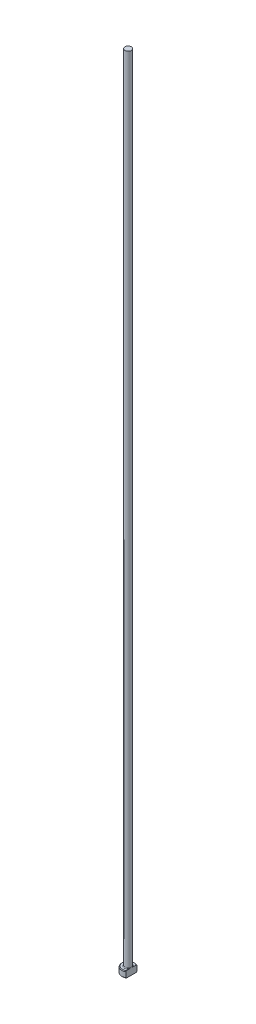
ISO-10303-21;
HEADER;
FILE_DESCRIPTION(('STEP AP214'),'2;1');
FILE_NAME('part.step','',(''),(''),'','','');
FILE_SCHEMA(('AUTOMOTIVE_DESIGN { 1 0 10303 214 1 1 1 1 }'));
ENDSEC;
DATA;
#1=APPLICATION_CONTEXT('core data for automotive mechanical design processes');
#2=APPLICATION_PROTOCOL_DEFINITION('international standard','automotive_design',2000,#1);
#3=PRODUCT_CONTEXT('',#1,'mechanical');
#4=PRODUCT('Part','Part','',(#3));
#5=PRODUCT_RELATED_PRODUCT_CATEGORY('part','',(#4));
#6=PRODUCT_DEFINITION_FORMATION('','',#4);
#7=PRODUCT_DEFINITION_CONTEXT('part definition',#1,'design');
#8=PRODUCT_DEFINITION('design','',#6,#7);
#9=PRODUCT_DEFINITION_SHAPE('','',#8);
#10=(LENGTH_UNIT() NAMED_UNIT(*) SI_UNIT(.MILLI.,.METRE.));
#11=(NAMED_UNIT(*) PLANE_ANGLE_UNIT() SI_UNIT($,.RADIAN.));
#12=(NAMED_UNIT(*) SI_UNIT($,.STERADIAN.) SOLID_ANGLE_UNIT());
#13=UNCERTAINTY_MEASURE_WITH_UNIT(LENGTH_MEASURE(1.E-05),#10,'distance_accuracy_value','');
#14=(GEOMETRIC_REPRESENTATION_CONTEXT(3) GLOBAL_UNCERTAINTY_ASSIGNED_CONTEXT((#13)) GLOBAL_UNIT_ASSIGNED_CONTEXT((#10,
#11,#12)) REPRESENTATION_CONTEXT('',''));
#15=CARTESIAN_POINT('',(0.,0.,0.));
#16=DIRECTION('',(0.,0.,1.));
#17=DIRECTION('',(1.,0.,0.));
#18=AXIS2_PLACEMENT_3D('',#15,#16,#17);
#19=CARTESIAN_POINT('',(0.,0.,0.));
#20=DIRECTION('',(0.,-1.,0.));
#21=DIRECTION('',(0.,0.,-1.));
#22=AXIS2_PLACEMENT_3D('',#19,#20,#21);
#23=PLANE('',#22);
#24=CARTESIAN_POINT('',(0.,0.,0.));
#25=DIRECTION('',(0.,-1.,0.));
#26=DIRECTION('',(0.,0.,-1.));
#27=AXIS2_PLACEMENT_3D('',#24,#25,#26);
#28=CIRCLE('',#27,1.8);
#29=CARTESIAN_POINT('',(0.999999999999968,0.,1.49666295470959));
#30=VERTEX_POINT('',#29);
#31=CARTESIAN_POINT('',(0.999999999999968,0.,-1.49666295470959));
#32=VERTEX_POINT('',#31);
#33=EDGE_CURVE('E98',#30,#32,#28,.T.);
#34=ORIENTED_EDGE('',*,*,#33,.T.);
#35=DIRECTION('',(0.,0.,1.));
#36=VECTOR('',#35,1.);
#37=CARTESIAN_POINT('',(0.999999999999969,0.,-1.73205080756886));
#38=LINE('',#37,#36);
#39=EDGE_CURVE('E83',#32,#30,#38,.T.);
#40=ORIENTED_EDGE('',*,*,#39,.T.);
#41=EDGE_LOOP('',(#34,#40));
#42=FACE_BOUND('',#41,.T.);
#43=ADVANCED_FACE('F32',(#42),#23,.T.);
#44=CARTESIAN_POINT('',(0.,259.958771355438,0.));
#45=DIRECTION('',(0.,1.,0.));
#46=DIRECTION('',(0.,0.,1.));
#47=AXIS2_PLACEMENT_3D('',#44,#45,#46);
#48=CYLINDRICAL_SURFACE('',#47,1.99999999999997);
#49=CARTESIAN_POINT('',(0.,1.79999999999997,0.));
#50=DIRECTION('',(0.,1.,0.));
#51=DIRECTION('',(0.,0.,1.));
#52=AXIS2_PLACEMENT_3D('',#49,#50,#51);
#53=CIRCLE('',#52,1.99999999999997);
#54=CARTESIAN_POINT('',(0.999999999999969,1.79999999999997,1.73205080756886));
#55=VERTEX_POINT('',#54);
#56=CARTESIAN_POINT('',(0.999999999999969,1.79999999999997,-1.73205080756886));
#57=VERTEX_POINT('',#56);
#58=EDGE_CURVE('E104',#55,#57,#53,.F.);
#59=ORIENTED_EDGE('',*,*,#58,.T.);
#60=DIRECTION('',(0.,-1.,0.));
#61=VECTOR('',#60,1.);
#62=CARTESIAN_POINT('',(0.999999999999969,250.,-1.73205080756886));
#63=LINE('',#62,#61);
#64=CARTESIAN_POINT('',(0.999999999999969,0.199999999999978,-1.73205080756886));
#65=VERTEX_POINT('',#64);
#66=EDGE_CURVE('E183',#57,#65,#63,.T.);
#67=ORIENTED_EDGE('',*,*,#66,.T.);
#68=CARTESIAN_POINT('',(0.,0.199999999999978,0.));
#69=DIRECTION('',(0.,-1.,0.));
#70=DIRECTION('',(0.,0.,-1.));
#71=AXIS2_PLACEMENT_3D('',#68,#69,#70);
#72=CIRCLE('',#71,1.99999999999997);
#73=CARTESIAN_POINT('',(0.999999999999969,0.199999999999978,1.73205080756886));
#74=VERTEX_POINT('',#73);
#75=EDGE_CURVE('E100',#65,#74,#72,.F.);
#76=ORIENTED_EDGE('',*,*,#75,.T.);
#77=DIRECTION('',(0.,-1.,0.));
#78=VECTOR('',#77,1.);
#79=CARTESIAN_POINT('',(0.999999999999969,250.,1.73205080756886));
#80=LINE('',#79,#78);
#81=EDGE_CURVE('E93',#55,#74,#80,.T.);
#82=ORIENTED_EDGE('',*,*,#81,.F.);
#83=EDGE_LOOP('',(#59,#67,#76,#82));
#84=FACE_BOUND('',#83,.T.);
#85=ADVANCED_FACE('F158',(#84),#48,.T.);
#86=CARTESIAN_POINT('',(-1.99999999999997,2.,0.));
#87=DIRECTION('',(0.,1.,0.));
#88=DIRECTION('',(0.,0.,1.));
#89=AXIS2_PLACEMENT_3D('',#86,#87,#88);
#90=PLANE('',#89);
#91=CARTESIAN_POINT('',(0.,2.,0.));
#92=DIRECTION('',(0.,1.,0.));
#93=DIRECTION('',(0.,0.,1.));
#94=AXIS2_PLACEMENT_3D('',#91,#92,#93);
#95=CIRCLE('',#94,1.79999999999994);
#96=CARTESIAN_POINT('',(0.999999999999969,2.,-1.49666295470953));
#97=VERTEX_POINT('',#96);
#98=CARTESIAN_POINT('',(0.999999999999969,2.,1.49666295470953));
#99=VERTEX_POINT('',#98);
#100=EDGE_CURVE('E178',#97,#99,#95,.T.);
#101=ORIENTED_EDGE('',*,*,#100,.T.);
#102=DIRECTION('',(0.,0.,-1.));
#103=VECTOR('',#102,1.);
#104=CARTESIAN_POINT('',(0.999999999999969,2.,0.));
#105=LINE('',#104,#103);
#106=CARTESIAN_POINT('',(0.999999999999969,1.99999999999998,0.66332495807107));
#107=VERTEX_POINT('',#106);
#108=EDGE_CURVE('E57',#99,#107,#105,.T.);
#109=ORIENTED_EDGE('',*,*,#108,.T.);
#110=CARTESIAN_POINT('',(0.,2.,0.));
#111=DIRECTION('',(0.,1.,0.));
#112=DIRECTION('',(0.,0.,1.));
#113=AXIS2_PLACEMENT_3D('',#110,#111,#112);
#114=CIRCLE('',#113,1.19999999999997);
#115=CARTESIAN_POINT('',(0.999999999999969,1.99999999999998,-0.663324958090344));
#116=VERTEX_POINT('',#115);
#117=EDGE_CURVE('E107',#107,#116,#114,.F.);
#118=ORIENTED_EDGE('',*,*,#117,.T.);
#119=EDGE_CURVE('E136',#116,#97,#105,.T.);
#120=ORIENTED_EDGE('',*,*,#119,.T.);
#121=EDGE_LOOP('',(#101,#109,#118,#120));
#122=FACE_BOUND('',#121,.T.);
#123=ADVANCED_FACE('F147',(#122),#90,.T.);
#124=CARTESIAN_POINT('',(0.,2.,0.));
#125=DIRECTION('',(0.,-1.,0.));
#126=DIRECTION('',(0.,0.,-1.));
#127=AXIS2_PLACEMENT_3D('',#124,#125,#126);
#128=CONICAL_SURFACE('',#127,1.79999999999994,0.785398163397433);
#129=ORIENTED_EDGE('',*,*,#58,.F.);
#130=CARTESIAN_POINT('',(0.999999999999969,-0.143084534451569,3.81417299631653));
#131=CARTESIAN_POINT('',(0.999999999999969,-0.059399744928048,3.72765647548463));
#132=CARTESIAN_POINT('',(0.999999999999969,0.0241940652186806,3.64105173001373));
#133=CARTESIAN_POINT('',(0.999999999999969,0.191148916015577,3.46761616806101));
#134=CARTESIAN_POINT('',(0.999999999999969,0.274509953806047,3.38078534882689));
#135=CARTESIAN_POINT('',(0.999999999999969,0.524249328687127,3.11979400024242));
#136=CARTESIAN_POINT('',(0.999999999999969,0.69019863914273,2.94522254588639));
#137=CARTESIAN_POINT('',(0.999999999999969,1.01697550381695,2.59782670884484));
#138=CARTESIAN_POINT('',(0.999999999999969,1.17783928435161,2.42503661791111));
#139=CARTESIAN_POINT('',(0.999999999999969,1.41669118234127,2.16364984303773));
#140=CARTESIAN_POINT('',(0.999999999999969,1.49589273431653,2.07616357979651));
#141=CARTESIAN_POINT('',(0.999999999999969,1.65313803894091,1.90015721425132));
#142=CARTESIAN_POINT('',(0.999999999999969,1.73118183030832,1.81163714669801));
#143=CARTESIAN_POINT('',(0.999999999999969,1.85567318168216,1.66767927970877));
#144=CARTESIAN_POINT('',(0.999999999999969,1.90265415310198,1.61270332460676));
#145=CARTESIAN_POINT('',(0.999999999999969,1.99577882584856,1.50203557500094));
#146=CARTESIAN_POINT('',(0.999999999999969,2.04192244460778,1.44634371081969));
#147=CARTESIAN_POINT('',(0.999999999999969,2.13356596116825,1.33345480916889));
#148=CARTESIAN_POINT('',(0.999999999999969,2.17905399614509,1.2762481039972));
#149=CARTESIAN_POINT('',(0.999999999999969,2.26844283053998,1.16060976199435));
#150=CARTESIAN_POINT('',(0.999999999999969,2.3123437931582,1.10217825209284));
#151=CARTESIAN_POINT('',(0.999999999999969,2.39853453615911,0.982773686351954));
#152=CARTESIAN_POINT('',(0.999999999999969,2.44078986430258,0.921775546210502));
#153=CARTESIAN_POINT('',(0.999999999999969,2.52187810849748,0.797387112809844));
#154=CARTESIAN_POINT('',(0.999999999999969,2.56070631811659,0.733993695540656));
#155=CARTESIAN_POINT('',(0.999999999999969,2.6324859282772,0.604932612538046));
#156=CARTESIAN_POINT('',(0.999999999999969,2.66550424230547,0.539302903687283));
#157=CARTESIAN_POINT('',(0.999999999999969,2.72301550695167,0.404437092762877));
#158=CARTESIAN_POINT('',(0.999999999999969,2.74753707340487,0.335214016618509));
#159=CARTESIAN_POINT('',(0.999999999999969,2.77407110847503,0.231400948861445));
#160=CARTESIAN_POINT('',(0.999999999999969,2.78110742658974,0.198093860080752));
#161=CARTESIAN_POINT('',(0.999999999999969,2.79200506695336,0.130954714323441));
#162=CARTESIAN_POINT('',(0.999999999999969,2.7958666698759,0.0971227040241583));
#163=CARTESIAN_POINT('',(0.999999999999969,2.80013905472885,0.0293410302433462));
#164=CARTESIAN_POINT('',(0.999999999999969,2.80056046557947,-0.00460794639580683));
#165=CARTESIAN_POINT('',(0.999999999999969,2.79795882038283,-0.0723663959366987));
#166=CARTESIAN_POINT('',(0.999999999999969,2.79493547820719,-0.106175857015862));
#167=CARTESIAN_POINT('',(0.999999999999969,2.78105481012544,-0.206326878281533));
#168=CARTESIAN_POINT('',(0.999999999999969,2.76542146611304,-0.272037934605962));
#169=CARTESIAN_POINT('',(0.999999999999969,2.73477554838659,-0.368312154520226));
#170=CARTESIAN_POINT('',(0.999999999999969,2.72331063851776,-0.400123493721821));
#171=CARTESIAN_POINT('',(0.999999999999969,2.69840546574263,-0.46296441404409));
#172=CARTESIAN_POINT('',(0.999999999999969,2.68496560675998,-0.493994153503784));
#173=CARTESIAN_POINT('',(0.999999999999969,2.64209309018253,-0.586298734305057));
#174=CARTESIAN_POINT('',(0.999999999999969,2.61022871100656,-0.64643570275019));
#175=CARTESIAN_POINT('',(0.999999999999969,2.5422853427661,-0.764304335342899));
#176=CARTESIAN_POINT('',(0.999999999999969,2.50620119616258,-0.822032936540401));
#177=CARTESIAN_POINT('',(0.999999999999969,2.43107084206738,-0.935840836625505));
#178=CARTESIAN_POINT('',(0.999999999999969,2.39201347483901,-0.99191270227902));
#179=CARTESIAN_POINT('',(0.999999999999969,2.31195870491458,-1.10259849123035));
#180=CARTESIAN_POINT('',(0.999999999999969,2.27096226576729,-1.15721311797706));
#181=CARTESIAN_POINT('',(0.999999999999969,2.18701695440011,-1.26606869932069));
#182=CARTESIAN_POINT('',(0.999999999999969,2.14404946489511,-1.32029522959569));
#183=CARTESIAN_POINT('',(0.999999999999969,2.0570505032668,-1.4278898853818));
#184=CARTESIAN_POINT('',(0.999999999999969,2.01301896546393,-1.48125795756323));
#185=CARTESIAN_POINT('',(0.999999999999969,1.87995068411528,-1.64010952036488));
#186=CARTESIAN_POINT('',(0.999999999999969,1.78973357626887,-1.74460261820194));
#187=CARTESIAN_POINT('',(0.999999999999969,1.62290341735,-1.93426834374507));
#188=CARTESIAN_POINT('',(0.999999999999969,1.54658658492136,-2.01970404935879));
#189=CARTESIAN_POINT('',(0.999999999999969,1.39301250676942,-2.18973019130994));
#190=CARTESIAN_POINT('',(0.999999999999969,1.31575523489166,-2.27432060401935));
#191=CARTESIAN_POINT('',(0.999999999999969,1.08283440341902,-2.52732479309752));
#192=CARTESIAN_POINT('',(0.999999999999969,0.926165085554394,-2.69481086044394));
#193=CARTESIAN_POINT('',(0.999999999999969,0.617772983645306,-3.02147252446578));
#194=CARTESIAN_POINT('',(0.999999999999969,0.466111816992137,-3.18070657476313));
#195=CARTESIAN_POINT('',(0.999999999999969,0.23801507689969,-3.41880818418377));
#196=CARTESIAN_POINT('',(0.999999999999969,0.161924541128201,-3.49800657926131));
#197=CARTESIAN_POINT('',(0.999999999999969,0.00955322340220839,-3.65621892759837));
#198=CARTESIAN_POINT('',(0.999999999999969,-0.0667275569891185,-3.73523288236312));
#199=CARTESIAN_POINT('',(0.999999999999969,-0.143084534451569,-3.81417299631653));
#200=B_SPLINE_CURVE_WITH_KNOTS('',3,(#130,#131,#132,#133,#134,#135,#136,#137,#138,#139,#140,
#141,#142,#143,#144,#145,#146,#147,#148,#149,#150,#151,#152,#153,#154,#155,#156,#157,#158,#159,
#160,#161,#162,#163,#164,#165,#166,#167,#168,#169,#170,#171,#172,#173,#174,#175,#176,#177,#178,
#179,#180,#181,#182,#183,#184,#185,#186,#187,#188,#189,#190,#191,#192,#193,#194,#195,#196,#197,
#198,#199),.UNSPECIFIED.,.F.,.F.,(4,2,2,2,2,2,2,2,2,2,2,2,2,2,2,2,2,2,2,2,2,2,2,2,2,2,2,2,2,2,2,
2,2,2,4),(0.,0.361101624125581,0.722207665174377,1.44478731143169,2.15299784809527,
2.50702638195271,2.8610430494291,3.07798416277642,3.29494655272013,3.51418925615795,
3.73340935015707,3.95594813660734,4.17878792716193,4.39886399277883,4.61819150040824,
4.72018864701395,4.82217677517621,4.92384967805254,5.02553102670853,5.22698459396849,
5.32838854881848,5.4297717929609,5.63365200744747,5.837784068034,6.04272417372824,
6.24756349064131,6.45510395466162,6.66265726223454,7.07676259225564,7.42043039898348,
7.7641077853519,8.45210822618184,9.1118082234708,9.44129145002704,9.77077197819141),.UNSPECIFIED.);
#201=EDGE_CURVE('E135',#55,#99,#200,.T.);
#202=ORIENTED_EDGE('',*,*,#201,.T.);
#203=ORIENTED_EDGE('',*,*,#100,.F.);
#204=EDGE_CURVE('E127',#97,#57,#200,.T.);
#205=ORIENTED_EDGE('',*,*,#204,.T.);
#206=EDGE_LOOP('',(#129,#202,#203,#205));
#207=FACE_BOUND('',#206,.T.);
#208=ADVANCED_FACE('F143',(#207),#128,.T.);
#209=CARTESIAN_POINT('',(0.,0.199999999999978,0.));
#210=DIRECTION('',(0.,1.,0.));
#211=DIRECTION('',(0.,0.,1.));
#212=AXIS2_PLACEMENT_3D('',#209,#210,#211);
#213=CONICAL_SURFACE('',#212,1.99999999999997,0.785398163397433);
#214=ORIENTED_EDGE('',*,*,#75,.F.);
#215=CARTESIAN_POINT('',(0.999999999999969,2.14308453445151,-3.81417299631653));
#216=CARTESIAN_POINT('',(0.999999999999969,2.05939974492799,-3.72765647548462));
#217=CARTESIAN_POINT('',(0.999999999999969,1.97580593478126,-3.64105173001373));
#218=CARTESIAN_POINT('',(0.999999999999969,1.80885108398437,-3.46761616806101));
#219=CARTESIAN_POINT('',(0.999999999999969,1.7254900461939,-3.38078534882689));
#220=CARTESIAN_POINT('',(0.999999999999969,1.47575067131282,-3.11979400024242));
#221=CARTESIAN_POINT('',(0.999999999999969,1.30980136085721,-2.94522254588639));
#222=CARTESIAN_POINT('',(0.999999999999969,0.983024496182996,-2.59782670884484));
#223=CARTESIAN_POINT('',(0.999999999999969,0.822160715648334,-2.42503661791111));
#224=CARTESIAN_POINT('',(0.999999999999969,0.583308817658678,-2.16364984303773));
#225=CARTESIAN_POINT('',(0.999999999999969,0.504107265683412,-2.07616357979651));
#226=CARTESIAN_POINT('',(0.999999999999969,0.346861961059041,-1.90015721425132));
#227=CARTESIAN_POINT('',(0.999999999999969,0.268818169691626,-1.81163714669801));
#228=CARTESIAN_POINT('',(0.999999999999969,0.144326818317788,-1.66767927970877));
#229=CARTESIAN_POINT('',(0.999999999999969,0.0973458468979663,-1.61270332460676));
#230=CARTESIAN_POINT('',(0.999999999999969,0.00422117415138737,-1.50203557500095));
#231=CARTESIAN_POINT('',(0.999999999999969,-0.0419224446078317,-1.44634371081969));
#232=CARTESIAN_POINT('',(0.999999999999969,-0.133565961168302,-1.3334548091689));
#233=CARTESIAN_POINT('',(0.999999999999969,-0.179053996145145,-1.2762481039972));
#234=CARTESIAN_POINT('',(0.999999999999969,-0.268442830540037,-1.16060976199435));
#235=CARTESIAN_POINT('',(0.999999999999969,-0.31234379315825,-1.10217825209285));
#236=CARTESIAN_POINT('',(0.999999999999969,-0.398534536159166,-0.982773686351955));
#237=CARTESIAN_POINT('',(0.999999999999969,-0.440789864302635,-0.921775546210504));
#238=CARTESIAN_POINT('',(0.999999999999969,-0.521878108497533,-0.797387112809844));
#239=CARTESIAN_POINT('',(0.999999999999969,-0.560706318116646,-0.733993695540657));
#240=CARTESIAN_POINT('',(0.999999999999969,-0.632485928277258,-0.604932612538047));
#241=CARTESIAN_POINT('',(0.999999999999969,-0.665504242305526,-0.539302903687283));
#242=CARTESIAN_POINT('',(0.999999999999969,-0.723015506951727,-0.404437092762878));
#243=CARTESIAN_POINT('',(0.999999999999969,-0.747537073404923,-0.33521401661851));
#244=CARTESIAN_POINT('',(0.999999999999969,-0.774071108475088,-0.231400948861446));
#245=CARTESIAN_POINT('',(0.999999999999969,-0.781107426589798,-0.198093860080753));
#246=CARTESIAN_POINT('',(0.999999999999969,-0.792005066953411,-0.130954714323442));
#247=CARTESIAN_POINT('',(0.999999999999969,-0.795866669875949,-0.0971227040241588));
#248=CARTESIAN_POINT('',(0.999999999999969,-0.8001390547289,-0.0293410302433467));
#249=CARTESIAN_POINT('',(0.999999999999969,-0.800560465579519,0.00460794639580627));
#250=CARTESIAN_POINT('',(0.999999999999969,-0.797958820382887,0.0723663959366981));
#251=CARTESIAN_POINT('',(0.999999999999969,-0.794935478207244,0.106175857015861));
#252=CARTESIAN_POINT('',(0.999999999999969,-0.78105481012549,0.206326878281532));
#253=CARTESIAN_POINT('',(0.999999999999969,-0.765421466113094,0.272037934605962));
#254=CARTESIAN_POINT('',(0.999999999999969,-0.734775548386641,0.368312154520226));
#255=CARTESIAN_POINT('',(0.999999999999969,-0.723310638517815,0.40012349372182));
#256=CARTESIAN_POINT('',(0.999999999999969,-0.698405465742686,0.46296441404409));
#257=CARTESIAN_POINT('',(0.999999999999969,-0.684965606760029,0.493994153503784));
#258=CARTESIAN_POINT('',(0.999999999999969,-0.642093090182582,0.586298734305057));
#259=CARTESIAN_POINT('',(0.999999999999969,-0.610228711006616,0.64643570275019));
#260=CARTESIAN_POINT('',(0.999999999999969,-0.542285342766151,0.764304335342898));
#261=CARTESIAN_POINT('',(0.999999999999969,-0.506201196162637,0.8220329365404));
#262=CARTESIAN_POINT('',(0.999999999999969,-0.431070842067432,0.935840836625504));
#263=CARTESIAN_POINT('',(0.999999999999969,-0.392013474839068,0.991912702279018));
#264=CARTESIAN_POINT('',(0.999999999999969,-0.311958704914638,1.10259849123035));
#265=CARTESIAN_POINT('',(0.999999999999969,-0.270962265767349,1.15721311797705));
#266=CARTESIAN_POINT('',(0.999999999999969,-0.187016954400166,1.26606869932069));
#267=CARTESIAN_POINT('',(0.999999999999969,-0.144049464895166,1.32029522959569));
#268=CARTESIAN_POINT('',(0.999999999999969,-0.0570505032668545,1.4278898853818));
#269=CARTESIAN_POINT('',(0.999999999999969,-0.013018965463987,1.48125795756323));
#270=CARTESIAN_POINT('',(0.999999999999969,0.120049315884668,1.64010952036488));
#271=CARTESIAN_POINT('',(0.999999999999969,0.210266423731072,1.74460261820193));
#272=CARTESIAN_POINT('',(0.999999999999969,0.377096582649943,1.93426834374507));
#273=CARTESIAN_POINT('',(0.999999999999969,0.453413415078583,2.01970404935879));
#274=CARTESIAN_POINT('',(0.999999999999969,0.60698749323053,2.18973019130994));
#275=CARTESIAN_POINT('',(0.999999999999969,0.684244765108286,2.27432060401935));
#276=CARTESIAN_POINT('',(0.999999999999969,0.917165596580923,2.52732479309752));
#277=CARTESIAN_POINT('',(0.999999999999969,1.07383491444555,2.69481086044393));
#278=CARTESIAN_POINT('',(0.999999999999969,1.38222701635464,3.02147252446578));
#279=CARTESIAN_POINT('',(0.999999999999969,1.53388818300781,3.18070657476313));
#280=CARTESIAN_POINT('',(0.999999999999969,1.76198492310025,3.41880818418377));
#281=CARTESIAN_POINT('',(0.999999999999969,1.83807545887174,3.49800657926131));
#282=CARTESIAN_POINT('',(0.999999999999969,1.99044677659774,3.65621892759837));
#283=CARTESIAN_POINT('',(0.999999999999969,2.06672755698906,3.73523288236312));
#284=CARTESIAN_POINT('',(0.999999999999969,2.14308453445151,3.81417299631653));
#285=B_SPLINE_CURVE_WITH_KNOTS('',3,(#215,#216,#217,#218,#219,#220,#221,#222,#223,#224,#225,
#226,#227,#228,#229,#230,#231,#232,#233,#234,#235,#236,#237,#238,#239,#240,#241,#242,#243,#244,
#245,#246,#247,#248,#249,#250,#251,#252,#253,#254,#255,#256,#257,#258,#259,#260,#261,#262,#263,
#264,#265,#266,#267,#268,#269,#270,#271,#272,#273,#274,#275,#276,#277,#278,#279,#280,#281,#282,
#283,#284),.UNSPECIFIED.,.F.,.F.,(4,2,2,2,2,2,2,2,2,2,2,2,2,2,2,2,2,2,2,2,2,2,2,2,2,2,2,2,2,2,2,
2,2,2,4),(0.,0.361101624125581,0.722207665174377,1.44478731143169,2.15299784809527,
2.5070263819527,2.8610430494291,3.07798416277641,3.29494655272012,3.51418925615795,
3.73340935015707,3.95594813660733,4.17878792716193,4.39886399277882,4.61819150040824,
4.72018864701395,4.82217677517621,4.92384967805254,5.02553102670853,5.22698459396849,
5.32838854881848,5.42977179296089,5.63365200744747,5.83778406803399,6.04272417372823,
6.24756349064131,6.45510395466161,6.66265726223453,7.07676259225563,7.42043039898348,
7.7641077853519,8.45210822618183,9.1118082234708,9.44129145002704,9.77077197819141),.UNSPECIFIED.);
#286=EDGE_CURVE('E86',#65,#32,#285,.T.);
#287=ORIENTED_EDGE('',*,*,#286,.T.);
#288=ORIENTED_EDGE('',*,*,#33,.F.);
#289=EDGE_CURVE('E89',#30,#74,#285,.T.);
#290=ORIENTED_EDGE('',*,*,#289,.T.);
#291=EDGE_LOOP('',(#214,#287,#288,#290));
#292=FACE_BOUND('',#291,.T.);
#293=ADVANCED_FACE('F97',(#292),#213,.T.);
#294=CARTESIAN_POINT('',(0.,2.19999999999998,0.));
#295=DIRECTION('',(0.,1.,0.));
#296=DIRECTION('',(0.,0.,1.));
#297=AXIS2_PLACEMENT_3D('',#294,#295,#296);
#298=TOROIDAL_SURFACE('',#297,1.19999999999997,0.2);
#299=CARTESIAN_POINT('',(0.999999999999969,2.19999999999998,0.));
#300=CARTESIAN_POINT('',(0.999999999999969,2.20000051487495,2.59077200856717E-12));
#301=CARTESIAN_POINT('',(0.999999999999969,2.20000102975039,-9.42496325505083E-08));
#302=CARTESIAN_POINT('',(0.999999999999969,2.20000202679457,-4.00799841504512E-07));
#303=CARTESIAN_POINT('',(0.999999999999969,2.20000250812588,-6.15372268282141E-07));
#304=CARTESIAN_POINT('',(0.999999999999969,2.20000346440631,-1.13351400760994E-06));
#305=CARTESIAN_POINT('',(0.999999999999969,2.20000393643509,-1.44235223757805E-06));
#306=CARTESIAN_POINT('',(0.999999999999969,2.20000483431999,-2.11388875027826E-06));
#307=CARTESIAN_POINT('',(0.999999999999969,2.20000526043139,-2.47625951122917E-06));
#308=CARTESIAN_POINT('',(0.999999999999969,2.20000666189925,-3.75794156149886E-06));
#309=CARTESIAN_POINT('',(0.999999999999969,2.20000757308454,-4.74818955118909E-06));
#310=CARTESIAN_POINT('',(0.999999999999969,2.20000922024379,-6.81289830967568E-06));
#311=CARTESIAN_POINT('',(0.999999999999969,2.20000996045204,-7.88417644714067E-06));
#312=CARTESIAN_POINT('',(0.999999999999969,2.20001267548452,-1.19907293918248E-05));
#313=CARTESIAN_POINT('',(0.999999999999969,2.20001450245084,-1.51274184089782E-05));
#314=CARTESIAN_POINT('',(0.999999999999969,2.20001755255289,-2.1371542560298E-05));
#315=CARTESIAN_POINT('',(0.999999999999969,2.20001881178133,-2.44620176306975E-05));
#316=CARTESIAN_POINT('',(0.999999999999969,2.20002404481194,-3.74145208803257E-05));
#317=CARTESIAN_POINT('',(0.999999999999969,2.20002793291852,-4.73052124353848E-05));
#318=CARTESIAN_POINT('',(0.999999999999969,2.2000342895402,-6.59457075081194E-05));
#319=CARTESIAN_POINT('',(0.999999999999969,2.2000368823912,-7.46515299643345E-05));
#320=CARTESIAN_POINT('',(0.999999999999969,2.20005709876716,-0.00013702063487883));
#321=CARTESIAN_POINT('',(0.999999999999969,2.20008244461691,-0.000187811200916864));
#322=CARTESIAN_POINT('',(0.999999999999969,2.20017671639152,-0.000384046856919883));
#323=CARTESIAN_POINT('',(0.999999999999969,2.20023990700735,-0.000531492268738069));
#324=CARTESIAN_POINT('',(0.999999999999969,2.20048701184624,-0.00109942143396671));
#325=CARTESIAN_POINT('',(0.999999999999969,2.20067693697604,-0.00151784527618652));
#326=CARTESIAN_POINT('',(0.999999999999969,2.20144296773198,-0.00321386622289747));
#327=CARTESIAN_POINT('',(0.999999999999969,2.20201230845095,-0.00449374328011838));
#328=CARTESIAN_POINT('',(0.999999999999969,2.20998444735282,-0.0224047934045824));
#329=CARTESIAN_POINT('',(0.999999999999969,2.2174352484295,-0.0390202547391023));
#330=CARTESIAN_POINT('',(0.999999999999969,2.2319700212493,-0.0717084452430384));
#331=CARTESIAN_POINT('',(0.999999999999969,2.23905766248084,-0.0877796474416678));
#332=CARTESIAN_POINT('',(0.999999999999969,2.25389009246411,-0.121781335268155));
#333=CARTESIAN_POINT('',(0.999999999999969,2.26161964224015,-0.139718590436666));
#334=CARTESIAN_POINT('',(0.999999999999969,2.27689168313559,-0.175878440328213));
#335=CARTESIAN_POINT('',(0.999999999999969,2.28443162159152,-0.194102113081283));
#336=CARTESIAN_POINT('',(0.999999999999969,2.30282726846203,-0.239840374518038));
#337=CARTESIAN_POINT('',(0.999999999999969,2.31345710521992,-0.267447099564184));
#338=CARTESIAN_POINT('',(0.999999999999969,2.33331094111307,-0.322481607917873));
#339=CARTESIAN_POINT('',(0.999999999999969,2.34256072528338,-0.349899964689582));
#340=CARTESIAN_POINT('',(0.999999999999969,2.35732089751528,-0.398044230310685));
#341=CARTESIAN_POINT('',(0.999999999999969,2.36317895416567,-0.41866173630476));
#342=CARTESIAN_POINT('',(0.999999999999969,2.37387907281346,-0.460275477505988));
#343=CARTESIAN_POINT('',(0.999999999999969,2.37871519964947,-0.481273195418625));
#344=CARTESIAN_POINT('',(0.999999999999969,2.39174175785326,-0.546853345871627));
#345=CARTESIAN_POINT('',(0.999999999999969,2.39776253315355,-0.591947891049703));
#346=CARTESIAN_POINT('',(0.999999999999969,2.40040174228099,-0.660990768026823));
#347=CARTESIAN_POINT('',(0.999999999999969,2.400126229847,-0.684818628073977));
#348=CARTESIAN_POINT('',(0.999999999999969,2.39660783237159,-0.732027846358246));
#349=CARTESIAN_POINT('',(0.999999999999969,2.39339826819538,-0.755411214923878));
#350=CARTESIAN_POINT('',(0.999999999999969,2.38447874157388,-0.796083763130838));
#351=CARTESIAN_POINT('',(0.999999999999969,2.37951676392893,-0.813533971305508));
#352=CARTESIAN_POINT('',(0.999999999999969,2.36698902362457,-0.84753143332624));
#353=CARTESIAN_POINT('',(0.999999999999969,2.35942232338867,-0.864078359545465));
#354=CARTESIAN_POINT('',(0.999999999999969,2.34431787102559,-0.89014154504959));
#355=CARTESIAN_POINT('',(0.999999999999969,2.33762931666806,-0.900148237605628));
#356=CARTESIAN_POINT('',(0.999999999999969,2.32281345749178,-0.9190336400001));
#357=CARTESIAN_POINT('',(0.999999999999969,2.3146887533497,-0.927914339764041));
#358=CARTESIAN_POINT('',(0.999999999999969,2.29878569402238,-0.942427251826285));
#359=CARTESIAN_POINT('',(0.999999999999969,2.29127620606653,-0.948352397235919));
#360=CARTESIAN_POINT('',(0.999999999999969,2.27538509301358,-0.958904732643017));
#361=CARTESIAN_POINT('',(0.999999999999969,2.26700378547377,-0.963532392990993));
#362=CARTESIAN_POINT('',(0.999999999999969,2.24944905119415,-0.971220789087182));
#363=CARTESIAN_POINT('',(0.999999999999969,2.24026913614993,-0.974266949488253));
#364=CARTESIAN_POINT('',(0.999999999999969,2.22148612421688,-0.978466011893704));
#365=CARTESIAN_POINT('',(0.999999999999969,2.21188346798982,-0.979620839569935));
#366=CARTESIAN_POINT('',(0.999999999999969,2.19406751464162,-0.979911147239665));
#367=CARTESIAN_POINT('',(0.999999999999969,2.18585759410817,-0.979318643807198));
#368=CARTESIAN_POINT('',(0.999999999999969,2.16966497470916,-0.976727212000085));
#369=CARTESIAN_POINT('',(0.999999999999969,2.16168225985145,-0.974728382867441));
#370=CARTESIAN_POINT('',(0.999999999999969,2.14632905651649,-0.969513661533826));
#371=CARTESIAN_POINT('',(0.999999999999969,2.13894889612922,-0.966325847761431));
#372=CARTESIAN_POINT('',(0.999999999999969,2.12474145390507,-0.958901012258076));
#373=CARTESIAN_POINT('',(0.999999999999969,2.11791436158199,-0.954663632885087));
#374=CARTESIAN_POINT('',(0.999999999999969,2.10210888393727,-0.943323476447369));
#375=CARTESIAN_POINT('',(0.999999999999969,2.09345388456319,-0.935769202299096));
#376=CARTESIAN_POINT('',(0.999999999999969,2.07747441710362,-0.919359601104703));
#377=CARTESIAN_POINT('',(0.999999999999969,2.07015330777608,-0.910501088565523));
#378=CARTESIAN_POINT('',(0.999999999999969,2.05394486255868,-0.887884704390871));
#379=CARTESIAN_POINT('',(0.999999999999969,2.04572469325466,-0.873650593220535));
#380=CARTESIAN_POINT('',(0.999999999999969,2.03162462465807,-0.844119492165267));
#381=CARTESIAN_POINT('',(0.999999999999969,2.02574383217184,-0.828822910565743));
#382=CARTESIAN_POINT('',(0.999999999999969,2.01314628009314,-0.78860523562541));
#383=CARTESIAN_POINT('',(0.999999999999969,2.00790637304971,-0.763225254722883));
#384=CARTESIAN_POINT('',(0.999999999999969,2.00123778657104,-0.711706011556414));
#385=CARTESIAN_POINT('',(0.999999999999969,1.99986086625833,-0.685561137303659));
#386=CARTESIAN_POINT('',(0.999999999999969,2.00029138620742,-0.610897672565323));
#387=CARTESIAN_POINT('',(0.999999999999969,2.00583944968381,-0.562408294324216));
#388=CARTESIAN_POINT('',(0.999999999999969,2.01894675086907,-0.492015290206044));
#389=CARTESIAN_POINT('',(0.999999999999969,2.02392178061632,-0.469516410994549));
#390=CARTESIAN_POINT('',(0.999999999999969,2.03507986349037,-0.424950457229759));
#391=CARTESIAN_POINT('',(0.999999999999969,2.04125559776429,-0.402881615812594));
#392=CARTESIAN_POINT('',(0.999999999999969,2.05640318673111,-0.353063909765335));
#393=CARTESIAN_POINT('',(0.999999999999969,2.06567810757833,-0.325409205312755));
#394=CARTESIAN_POINT('',(0.999999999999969,2.08561584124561,-0.269900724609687));
#395=CARTESIAN_POINT('',(0.999999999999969,2.0963053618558,-0.242056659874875));
#396=CARTESIAN_POINT('',(0.999999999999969,2.11482832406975,-0.195905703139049));
#397=CARTESIAN_POINT('',(0.999999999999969,2.12243033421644,-0.177504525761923));
#398=CARTESIAN_POINT('',(0.999999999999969,2.13783353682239,-0.140994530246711));
#399=CARTESIAN_POINT('',(0.999999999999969,2.1456321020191,-0.122884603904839));
#400=CARTESIAN_POINT('',(0.999999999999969,2.16059970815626,-0.0885577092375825));
#401=CARTESIAN_POINT('',(0.999999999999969,2.16775305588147,-0.0723337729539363));
#402=CARTESIAN_POINT('',(0.999999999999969,2.18242403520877,-0.0393353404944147));
#403=CARTESIAN_POINT('',(0.999999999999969,2.18994542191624,-0.0225624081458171));
#404=CARTESIAN_POINT('',(0.999999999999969,2.19798770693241,-0.00449370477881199));
#405=CARTESIAN_POINT('',(0.999999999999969,2.19855706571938,-0.00321379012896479));
#406=CARTESIAN_POINT('',(0.999999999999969,2.19932310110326,-0.00151776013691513));
#407=CARTESIAN_POINT('',(0.999999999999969,2.1995130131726,-0.00109936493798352));
#408=CARTESIAN_POINT('',(0.999999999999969,2.19976010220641,-0.000531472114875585));
#409=CARTESIAN_POINT('',(0.999999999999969,2.19982328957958,-0.000384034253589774));
#410=CARTESIAN_POINT('',(0.999999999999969,2.19991755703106,-0.000187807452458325));
#411=CARTESIAN_POINT('',(0.999999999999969,2.19994290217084,-0.00013701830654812));
#412=CARTESIAN_POINT('',(0.999999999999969,2.19996311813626,-7.46508463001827E-05));
#413=CARTESIAN_POINT('',(0.999999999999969,2.19996571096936,-6.59451379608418E-05));
#414=CARTESIAN_POINT('',(0.999999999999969,2.19997206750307,-4.73048898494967E-05));
#415=CARTESIAN_POINT('',(0.999999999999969,2.1999759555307,-3.74143280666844E-05));
#416=CARTESIAN_POINT('',(0.999999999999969,2.19998118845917,-2.44619706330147E-05));
#417=CARTESIAN_POINT('',(0.999999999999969,2.19998244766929,-2.13715141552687E-05));
#418=CARTESIAN_POINT('',(0.999999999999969,2.199985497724,-1.51274243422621E-05));
#419=CARTESIAN_POINT('',(0.999999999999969,2.19998732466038,-1.19907504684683E-05));
#420=CARTESIAN_POINT('',(0.999999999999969,2.1999900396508,-7.88421137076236E-06));
#421=CARTESIAN_POINT('',(0.999999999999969,2.19999077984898,-6.81293469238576E-06));
#422=CARTESIAN_POINT('',(0.999999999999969,2.19999242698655,-4.74822681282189E-06));
#423=CARTESIAN_POINT('',(0.999999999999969,2.19999333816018,-3.75797816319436E-06));
#424=CARTESIAN_POINT('',(0.999999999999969,2.19999473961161,-2.47629275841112E-06));
#425=CARTESIAN_POINT('',(0.999999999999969,2.19999516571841,-2.11392054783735E-06));
#426=CARTESIAN_POINT('',(0.999999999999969,2.1999960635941,-1.44238031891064E-06));
#427=CARTESIAN_POINT('',(0.999999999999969,2.19999653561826,-1.13353981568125E-06));
#428=CARTESIAN_POINT('',(0.999999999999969,2.19999749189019,-6.15392568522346E-07));
#429=CARTESIAN_POINT('',(0.999999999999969,2.1999979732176,-4.00816998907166E-07));
#430=CARTESIAN_POINT('',(0.999999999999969,2.19999897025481,-9.42592107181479E-08));
#431=CARTESIAN_POINT('',(0.999999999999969,2.19999948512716,-2.59076122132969E-12));
#432=CARTESIAN_POINT('',(0.999999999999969,2.19999999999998,0.));
#433=B_SPLINE_CURVE_WITH_KNOTS('',3,(#299,#300,#301,#302,#303,#304,#305,#306,#307,#308,#309,
#310,#311,#312,#313,#314,#315,#316,#317,#318,#319,#320,#321,#322,#323,#324,#325,#326,#327,#328,
#329,#330,#331,#332,#333,#334,#335,#336,#337,#338,#339,#340,#341,#342,#343,#344,#345,#346,#347,
#348,#349,#350,#351,#352,#353,#354,#355,#356,#357,#358,#359,#360,#361,#362,#363,#364,#365,#366,
#367,#368,#369,#370,#371,#372,#373,#374,#375,#376,#377,#378,#379,#380,#381,#382,#383,#384,#385,
#386,#387,#388,#389,#390,#391,#392,#393,#394,#395,#396,#397,#398,#399,#400,#401,#402,#403,#404,
#405,#406,#407,#408,#409,#410,#411,#412,#413,#414,#415,#416,#417,#418,#419,#420,#421,#422,#423,
#424,#425,#426,#427,#428,#429,#430,#431,#432),.UNSPECIFIED.,.T.,.F.,(4,2,2,2,2,2,2,2,2,2,2,2,2,
2,2,2,2,2,2,2,2,2,2,2,2,2,2,2,2,2,2,2,2,2,2,2,2,2,2,2,2,2,2,2,2,2,2,2,2,2,2,2,2,2,2,2,2,2,2,2,2,
2,2,2,2,2,4),(0.,1.54318097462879E-06,3.11656716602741E-06,4.80252030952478E-06,
6.47855574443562E-06,1.04956563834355E-05,1.43988918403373E-05,2.52504396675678E-05,
3.5251842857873E-05,6.71249460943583E-05,9.4349675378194E-05,0.0002638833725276,
0.000745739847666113,0.00212351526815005,0.00632669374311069,0.060948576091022,0.11364394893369,
0.172237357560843,0.23140101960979,0.32012930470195,0.406905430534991,0.471177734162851,
0.535813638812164,0.67161710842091,0.742973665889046,0.813529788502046,0.867802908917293,
0.922095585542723,0.958095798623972,0.994031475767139,1.02261929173,1.05119673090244,
1.08003306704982,1.10884002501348,1.13341017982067,1.15797860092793,1.18200020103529,
1.20602999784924,1.24030227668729,1.27465969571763,1.32369575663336,1.37271307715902,
1.4500242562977,1.52836647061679,1.67385288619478,1.74297459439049,1.81168748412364,
1.89915940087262,1.9886152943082,2.04834216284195,2.10749314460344,2.16068730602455,
2.21582681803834,2.2200301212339,2.22140780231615,2.2218896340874,2.22205916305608,
2.22208638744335,2.22211826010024,2.22212826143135,2.22213911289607,2.2221430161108,
2.22214703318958,2.22214870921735,2.22215039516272,2.22215196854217,2.22215351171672),.UNSPECIFIED.);
#434=CARTESIAN_POINT('',(0.999999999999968,2.19999999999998,0.));
#435=VERTEX_POINT('',#434);
#436=EDGE_CURVE('E11',#116,#435,#433,.T.);
#437=ORIENTED_EDGE('',*,*,#436,.F.);
#438=ORIENTED_EDGE('',*,*,#117,.F.);
#439=CARTESIAN_POINT('',(0.999999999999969,2.19999999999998,0.));
#440=CARTESIAN_POINT('',(0.999999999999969,2.19999948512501,-2.59076884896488E-12));
#441=CARTESIAN_POINT('',(0.999999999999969,2.19999897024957,9.42496325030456E-08));
#442=CARTESIAN_POINT('',(0.999999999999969,2.19999797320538,4.00799841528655E-07));
#443=CARTESIAN_POINT('',(0.999999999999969,2.19999749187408,6.15372268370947E-07));
#444=CARTESIAN_POINT('',(0.999999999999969,2.19999653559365,1.1335140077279E-06));
#445=CARTESIAN_POINT('',(0.999999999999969,2.19999606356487,1.44235223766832E-06));
#446=CARTESIAN_POINT('',(0.999999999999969,2.19999516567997,2.11388875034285E-06));
#447=CARTESIAN_POINT('',(0.999999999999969,2.19999473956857,2.47625951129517E-06));
#448=CARTESIAN_POINT('',(0.999999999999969,2.19999333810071,3.75794156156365E-06));
#449=CARTESIAN_POINT('',(0.999999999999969,2.19999242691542,4.74818955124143E-06));
#450=CARTESIAN_POINT('',(0.999999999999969,2.19999077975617,6.81289830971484E-06));
#451=CARTESIAN_POINT('',(0.999999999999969,2.19999003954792,7.88417644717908E-06));
#452=CARTESIAN_POINT('',(0.999999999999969,2.19998732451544,1.19907293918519E-05));
#453=CARTESIAN_POINT('',(0.999999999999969,2.19998549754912,1.51274184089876E-05));
#454=CARTESIAN_POINT('',(0.999999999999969,2.19998244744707,2.13715425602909E-05));
#455=CARTESIAN_POINT('',(0.999999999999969,2.19998118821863,2.44620176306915E-05));
#456=CARTESIAN_POINT('',(0.999999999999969,2.19997595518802,3.74145208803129E-05));
#457=CARTESIAN_POINT('',(0.999999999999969,2.19997206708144,4.7305212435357E-05));
#458=CARTESIAN_POINT('',(0.999999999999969,2.19996571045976,6.59457075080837E-05));
#459=CARTESIAN_POINT('',(0.999999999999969,2.19996311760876,7.46515299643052E-05));
#460=CARTESIAN_POINT('',(0.999999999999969,2.1999429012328,0.000137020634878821));
#461=CARTESIAN_POINT('',(0.999999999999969,2.19991755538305,0.000187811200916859));
#462=CARTESIAN_POINT('',(0.999999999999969,2.19982328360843,0.000384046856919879));
#463=CARTESIAN_POINT('',(0.999999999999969,2.19976009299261,0.000531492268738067));
#464=CARTESIAN_POINT('',(0.999999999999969,2.19951298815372,0.00109942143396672));
#465=CARTESIAN_POINT('',(0.999999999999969,2.19932306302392,0.00151784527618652));
#466=CARTESIAN_POINT('',(0.999999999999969,2.19855703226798,0.00321386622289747));
#467=CARTESIAN_POINT('',(0.999999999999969,2.19798769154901,0.00449374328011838));
#468=CARTESIAN_POINT('',(0.999999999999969,2.19001555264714,0.0224047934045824));
#469=CARTESIAN_POINT('',(0.999999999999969,2.18256475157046,0.0390202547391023));
#470=CARTESIAN_POINT('',(0.999999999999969,2.16802997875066,0.0717084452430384));
#471=CARTESIAN_POINT('',(0.999999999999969,2.16094233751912,0.0877796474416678));
#472=CARTESIAN_POINT('',(0.999999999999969,2.14610990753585,0.121781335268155));
#473=CARTESIAN_POINT('',(0.999999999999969,2.13838035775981,0.139718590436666));
#474=CARTESIAN_POINT('',(0.999999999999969,2.12310831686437,0.175878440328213));
#475=CARTESIAN_POINT('',(0.999999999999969,2.11556837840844,0.194102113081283));
#476=CARTESIAN_POINT('',(0.999999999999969,2.09717273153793,0.239840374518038));
#477=CARTESIAN_POINT('',(0.999999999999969,2.08654289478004,0.267447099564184));
#478=CARTESIAN_POINT('',(0.999999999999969,2.06668905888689,0.322481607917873));
#479=CARTESIAN_POINT('',(0.999999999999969,2.05743927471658,0.349899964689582));
#480=CARTESIAN_POINT('',(0.999999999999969,2.04267910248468,0.398044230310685));
#481=CARTESIAN_POINT('',(0.999999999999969,2.03682104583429,0.41866173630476));
#482=CARTESIAN_POINT('',(0.999999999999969,2.0261209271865,0.460275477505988));
#483=CARTESIAN_POINT('',(0.999999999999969,2.02128480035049,0.481273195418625));
#484=CARTESIAN_POINT('',(0.999999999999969,2.0082582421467,0.546853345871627));
#485=CARTESIAN_POINT('',(0.999999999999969,2.00223746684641,0.591947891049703));
#486=CARTESIAN_POINT('',(0.999999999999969,1.99959825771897,0.660990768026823));
#487=CARTESIAN_POINT('',(0.999999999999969,1.99987377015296,0.684818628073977));
#488=CARTESIAN_POINT('',(0.999999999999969,2.00339216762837,0.732027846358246));
#489=CARTESIAN_POINT('',(0.999999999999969,2.00660173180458,0.755411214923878));
#490=CARTESIAN_POINT('',(0.999999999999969,2.01552125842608,0.796083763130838));
#491=CARTESIAN_POINT('',(0.999999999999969,2.02048323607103,0.813533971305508));
#492=CARTESIAN_POINT('',(0.999999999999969,2.03301097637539,0.84753143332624));
#493=CARTESIAN_POINT('',(0.999999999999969,2.04057767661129,0.864078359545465));
#494=CARTESIAN_POINT('',(0.999999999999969,2.05568212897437,0.89014154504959));
#495=CARTESIAN_POINT('',(0.999999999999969,2.0623706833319,0.900148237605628));
#496=CARTESIAN_POINT('',(0.999999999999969,2.07718654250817,0.9190336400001));
#497=CARTESIAN_POINT('',(0.999999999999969,2.08531124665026,0.927914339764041));
#498=CARTESIAN_POINT('',(0.999999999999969,2.10121430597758,0.942427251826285));
#499=CARTESIAN_POINT('',(0.999999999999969,2.10872379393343,0.948352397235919));
#500=CARTESIAN_POINT('',(0.999999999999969,2.12461490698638,0.958904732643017));
#501=CARTESIAN_POINT('',(0.999999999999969,2.13299621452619,0.963532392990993));
#502=CARTESIAN_POINT('',(0.999999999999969,2.15055094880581,0.971220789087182));
#503=CARTESIAN_POINT('',(0.999999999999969,2.15973086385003,0.974266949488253));
#504=CARTESIAN_POINT('',(0.999999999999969,2.17851387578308,0.978466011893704));
#505=CARTESIAN_POINT('',(0.999999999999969,2.18811653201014,0.979620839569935));
#506=CARTESIAN_POINT('',(0.999999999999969,2.20593248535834,0.979911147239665));
#507=CARTESIAN_POINT('',(0.999999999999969,2.21414240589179,0.979318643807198));
#508=CARTESIAN_POINT('',(0.999999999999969,2.23033502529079,0.976727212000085));
#509=CARTESIAN_POINT('',(0.999999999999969,2.23831774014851,0.974728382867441));
#510=CARTESIAN_POINT('',(0.999999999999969,2.25367094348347,0.969513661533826));
#511=CARTESIAN_POINT('',(0.999999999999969,2.26105110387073,0.966325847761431));
#512=CARTESIAN_POINT('',(0.999999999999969,2.27525854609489,0.958901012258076));
#513=CARTESIAN_POINT('',(0.999999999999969,2.28208563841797,0.954663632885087));
#514=CARTESIAN_POINT('',(0.999999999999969,2.29789111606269,0.943323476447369));
#515=CARTESIAN_POINT('',(0.999999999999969,2.30654611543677,0.935769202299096));
#516=CARTESIAN_POINT('',(0.999999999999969,2.32252558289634,0.919359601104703));
#517=CARTESIAN_POINT('',(0.999999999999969,2.32984669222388,0.910501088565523));
#518=CARTESIAN_POINT('',(0.999999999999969,2.34605513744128,0.887884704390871));
#519=CARTESIAN_POINT('',(0.999999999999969,2.3542753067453,0.873650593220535));
#520=CARTESIAN_POINT('',(0.999999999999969,2.36837537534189,0.844119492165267));
#521=CARTESIAN_POINT('',(0.999999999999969,2.37425616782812,0.828822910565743));
#522=CARTESIAN_POINT('',(0.999999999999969,2.38685371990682,0.78860523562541));
#523=CARTESIAN_POINT('',(0.999999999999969,2.39209362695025,0.763225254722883));
#524=CARTESIAN_POINT('',(0.999999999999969,2.39876221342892,0.711706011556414));
#525=CARTESIAN_POINT('',(0.999999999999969,2.40013913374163,0.685561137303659));
#526=CARTESIAN_POINT('',(0.999999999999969,2.39970861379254,0.610897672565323));
#527=CARTESIAN_POINT('',(0.999999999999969,2.39416055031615,0.562408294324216));
#528=CARTESIAN_POINT('',(0.999999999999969,2.38105324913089,0.492015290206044));
#529=CARTESIAN_POINT('',(0.999999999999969,2.37607821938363,0.469516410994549));
#530=CARTESIAN_POINT('',(0.999999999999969,2.36492013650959,0.424950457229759));
#531=CARTESIAN_POINT('',(0.999999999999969,2.35874440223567,0.402881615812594));
#532=CARTESIAN_POINT('',(0.999999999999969,2.34359681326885,0.353063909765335));
#533=CARTESIAN_POINT('',(0.999999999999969,2.33432189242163,0.325409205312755));
#534=CARTESIAN_POINT('',(0.999999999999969,2.31438415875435,0.269900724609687));
#535=CARTESIAN_POINT('',(0.999999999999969,2.30369463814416,0.242056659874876));
#536=CARTESIAN_POINT('',(0.999999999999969,2.28517167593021,0.195905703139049));
#537=CARTESIAN_POINT('',(0.999999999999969,2.27756966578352,0.177504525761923));
#538=CARTESIAN_POINT('',(0.999999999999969,2.26216646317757,0.140994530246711));
#539=CARTESIAN_POINT('',(0.999999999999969,2.25436789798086,0.122884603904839));
#540=CARTESIAN_POINT('',(0.999999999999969,2.2394002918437,0.0885577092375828));
#541=CARTESIAN_POINT('',(0.999999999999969,2.23224694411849,0.072333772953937));
#542=CARTESIAN_POINT('',(0.999999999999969,2.21757596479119,0.0393353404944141));
#543=CARTESIAN_POINT('',(0.999999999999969,2.21005457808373,0.0225624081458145));
#544=CARTESIAN_POINT('',(0.999999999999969,2.20201229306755,0.00449370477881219));
#545=CARTESIAN_POINT('',(0.999999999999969,2.20144293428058,0.00321379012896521));
#546=CARTESIAN_POINT('',(0.999999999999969,2.2006768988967,0.00151776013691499));
#547=CARTESIAN_POINT('',(0.999999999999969,2.20048698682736,0.00109936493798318));
#548=CARTESIAN_POINT('',(0.999999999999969,2.20023989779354,0.000531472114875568));
#549=CARTESIAN_POINT('',(0.999999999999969,2.20017671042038,0.000384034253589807));
#550=CARTESIAN_POINT('',(0.999999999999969,2.2000824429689,0.000187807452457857));
#551=CARTESIAN_POINT('',(0.999999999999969,2.20005709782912,0.000137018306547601));
#552=CARTESIAN_POINT('',(0.999999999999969,2.2000368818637,7.46508463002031E-05));
#553=CARTESIAN_POINT('',(0.999999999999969,2.2000342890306,6.59451379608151E-05));
#554=CARTESIAN_POINT('',(0.999999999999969,2.20002793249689,4.73048898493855E-05));
#555=CARTESIAN_POINT('',(0.999999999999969,2.20002404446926,3.74143280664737E-05));
#556=CARTESIAN_POINT('',(0.999999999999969,2.20001881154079,2.44619706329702E-05));
#557=CARTESIAN_POINT('',(0.999999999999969,2.20001755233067,2.1371514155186E-05));
#558=CARTESIAN_POINT('',(0.999999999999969,2.20001450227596,1.51274243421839E-05));
#559=CARTESIAN_POINT('',(0.999999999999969,2.20001267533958,1.19907504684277E-05));
#560=CARTESIAN_POINT('',(0.999999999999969,2.20000996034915,7.88421137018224E-06));
#561=CARTESIAN_POINT('',(0.999999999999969,2.20000922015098,6.81293469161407E-06));
#562=CARTESIAN_POINT('',(0.999999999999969,2.20000757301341,4.74822681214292E-06));
#563=CARTESIAN_POINT('',(0.999999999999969,2.20000666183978,3.75797816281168E-06));
#564=CARTESIAN_POINT('',(0.999999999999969,2.20000526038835,2.47629275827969E-06));
#565=CARTESIAN_POINT('',(0.999999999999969,2.20000483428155,2.11392054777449E-06));
#566=CARTESIAN_POINT('',(0.999999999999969,2.20000393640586,1.44238031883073E-06));
#567=CARTESIAN_POINT('',(0.999999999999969,2.2000034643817,1.13353981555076E-06));
#568=CARTESIAN_POINT('',(0.999999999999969,2.20000250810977,6.15392568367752E-07));
#569=CARTESIAN_POINT('',(0.999999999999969,2.20000202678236,4.00816998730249E-07));
#570=CARTESIAN_POINT('',(0.999999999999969,2.20000102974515,9.4259210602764E-08));
#571=CARTESIAN_POINT('',(0.999999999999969,2.2000005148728,2.5907580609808E-12));
#572=CARTESIAN_POINT('',(0.999999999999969,2.19999999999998,0.));
#573=B_SPLINE_CURVE_WITH_KNOTS('',3,(#439,#440,#441,#442,#443,#444,#445,#446,#447,#448,#449,
#450,#451,#452,#453,#454,#455,#456,#457,#458,#459,#460,#461,#462,#463,#464,#465,#466,#467,#468,
#469,#470,#471,#472,#473,#474,#475,#476,#477,#478,#479,#480,#481,#482,#483,#484,#485,#486,#487,
#488,#489,#490,#491,#492,#493,#494,#495,#496,#497,#498,#499,#500,#501,#502,#503,#504,#505,#506,
#507,#508,#509,#510,#511,#512,#513,#514,#515,#516,#517,#518,#519,#520,#521,#522,#523,#524,#525,
#526,#527,#528,#529,#530,#531,#532,#533,#534,#535,#536,#537,#538,#539,#540,#541,#542,#543,#544,
#545,#546,#547,#548,#549,#550,#551,#552,#553,#554,#555,#556,#557,#558,#559,#560,#561,#562,#563,
#564,#565,#566,#567,#568,#569,#570,#571,#572),.UNSPECIFIED.,.T.,.F.,(4,2,2,2,2,2,2,2,2,2,2,2,2,
2,2,2,2,2,2,2,2,2,2,2,2,2,2,2,2,2,2,2,2,2,2,2,2,2,2,2,2,2,2,2,2,2,2,2,2,2,2,2,2,2,2,2,2,2,2,2,2,
2,2,2,2,2,4),(0.,1.54318097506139E-06,3.11656716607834E-06,4.80252030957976E-06,
6.47855574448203E-06,1.04956563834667E-05,1.43988918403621E-05,2.52504396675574E-05,
3.52518428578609E-05,6.7124946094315E-05,9.43496753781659E-05,0.000263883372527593,
0.000745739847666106,0.00212351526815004,0.00632669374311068,0.060948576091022,0.11364394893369,
0.172237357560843,0.23140101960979,0.32012930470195,0.406905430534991,0.471177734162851,
0.535813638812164,0.67161710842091,0.742973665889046,0.813529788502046,0.867802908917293,
0.922095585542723,0.958095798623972,0.994031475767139,1.02261929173,1.05119673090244,
1.08003306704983,1.10884002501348,1.13341017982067,1.15797860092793,1.18200020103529,
1.20602999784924,1.24030227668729,1.27465969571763,1.32369575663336,1.37271307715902,
1.4500242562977,1.52836647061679,1.67385288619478,1.74297459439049,1.81168748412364,
1.89915940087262,1.9886152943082,2.04834216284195,2.10749314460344,2.16068730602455,
2.21582681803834,2.2200301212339,2.22140780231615,2.2218896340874,2.22205916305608,
2.22208638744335,2.22211826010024,2.22212826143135,2.22213911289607,2.2221430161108,
2.22214703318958,2.22214870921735,2.22215039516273,2.22215196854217,2.22215351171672),.UNSPECIFIED.);
#574=EDGE_CURVE('E46',#435,#107,#573,.T.);
#575=ORIENTED_EDGE('',*,*,#574,.F.);
#576=CARTESIAN_POINT('',(0.,2.19999999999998,0.));
#577=DIRECTION('',(0.,1.,0.));
#578=DIRECTION('',(0.,0.,1.));
#579=AXIS2_PLACEMENT_3D('',#576,#577,#578);
#580=CIRCLE('',#579,0.999999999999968);
#581=EDGE_CURVE('E103',#435,#435,#580,.T.);
#582=ORIENTED_EDGE('',*,*,#581,.F.);
#583=EDGE_LOOP('',(#437,#438,#575,#582));
#584=FACE_BOUND('',#583,.T.);
#585=ADVANCED_FACE('F34',(#584),#298,.F.);
#586=CARTESIAN_POINT('',(0.,259.958771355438,0.));
#587=DIRECTION('',(0.,1.,0.));
#588=DIRECTION('',(0.,0.,1.));
#589=AXIS2_PLACEMENT_3D('',#586,#587,#588);
#590=CYLINDRICAL_SURFACE('',#589,0.999999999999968);
#591=ORIENTED_EDGE('',*,*,#581,.T.);
#592=EDGE_LOOP('',(#591));
#593=FACE_BOUND('',#592,.T.);
#594=CARTESIAN_POINT('',(0.,250.,0.));
#595=DIRECTION('',(0.,1.,0.));
#596=DIRECTION('',(0.,0.,1.));
#597=AXIS2_PLACEMENT_3D('',#594,#595,#596);
#598=CIRCLE('',#597,0.999999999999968);
#599=CARTESIAN_POINT('',(0.,250.,0.999999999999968));
#600=VERTEX_POINT('',#599);
#601=EDGE_CURVE('E101',#600,#600,#598,.T.);
#602=ORIENTED_EDGE('',*,*,#601,.F.);
#603=EDGE_LOOP('',(#602));
#604=FACE_BOUND('',#603,.T.);
#605=ADVANCED_FACE('F155',(#593,#604),#590,.T.);
#606=CARTESIAN_POINT('',(-0.999999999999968,250.,0.));
#607=DIRECTION('',(0.,1.,0.));
#608=DIRECTION('',(0.,0.,1.));
#609=AXIS2_PLACEMENT_3D('',#606,#607,#608);
#610=PLANE('',#609);
#611=ORIENTED_EDGE('',*,*,#601,.T.);
#612=EDGE_LOOP('',(#611));
#613=FACE_BOUND('',#612,.T.);
#614=ADVANCED_FACE('F121',(#613),#610,.T.);
#615=CARTESIAN_POINT('',(0.999999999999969,250.,-1.73205080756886));
#616=DIRECTION('',(1.,0.,0.));
#617=DIRECTION('',(0.,0.,-1.));
#618=AXIS2_PLACEMENT_3D('',#615,#616,#617);
#619=PLANE('',#618);
#620=ORIENTED_EDGE('',*,*,#66,.F.);
#621=ORIENTED_EDGE('',*,*,#204,.F.);
#622=ORIENTED_EDGE('',*,*,#119,.F.);
#623=ORIENTED_EDGE('',*,*,#436,.T.);
#624=ORIENTED_EDGE('',*,*,#574,.T.);
#625=ORIENTED_EDGE('',*,*,#108,.F.);
#626=ORIENTED_EDGE('',*,*,#201,.F.);
#627=ORIENTED_EDGE('',*,*,#81,.T.);
#628=ORIENTED_EDGE('',*,*,#289,.F.);
#629=ORIENTED_EDGE('',*,*,#39,.F.);
#630=ORIENTED_EDGE('',*,*,#286,.F.);
#631=EDGE_LOOP('',(#620,#621,#622,#623,#624,#625,#626,#627,#628,#629,#630));
#632=FACE_BOUND('',#631,.T.);
#633=ADVANCED_FACE('F85',(#632),#619,.T.);
#634=CLOSED_SHELL('',(#43,#85,#123,#208,#293,#585,#605,#614,#633));
#635=MANIFOLD_SOLID_BREP('B2',#634);
#636=ADVANCED_BREP_SHAPE_REPRESENTATION('',(#18,#635),#14);
#637=SHAPE_DEFINITION_REPRESENTATION(#9,#636);
ENDSEC;
END-ISO-10303-21;
